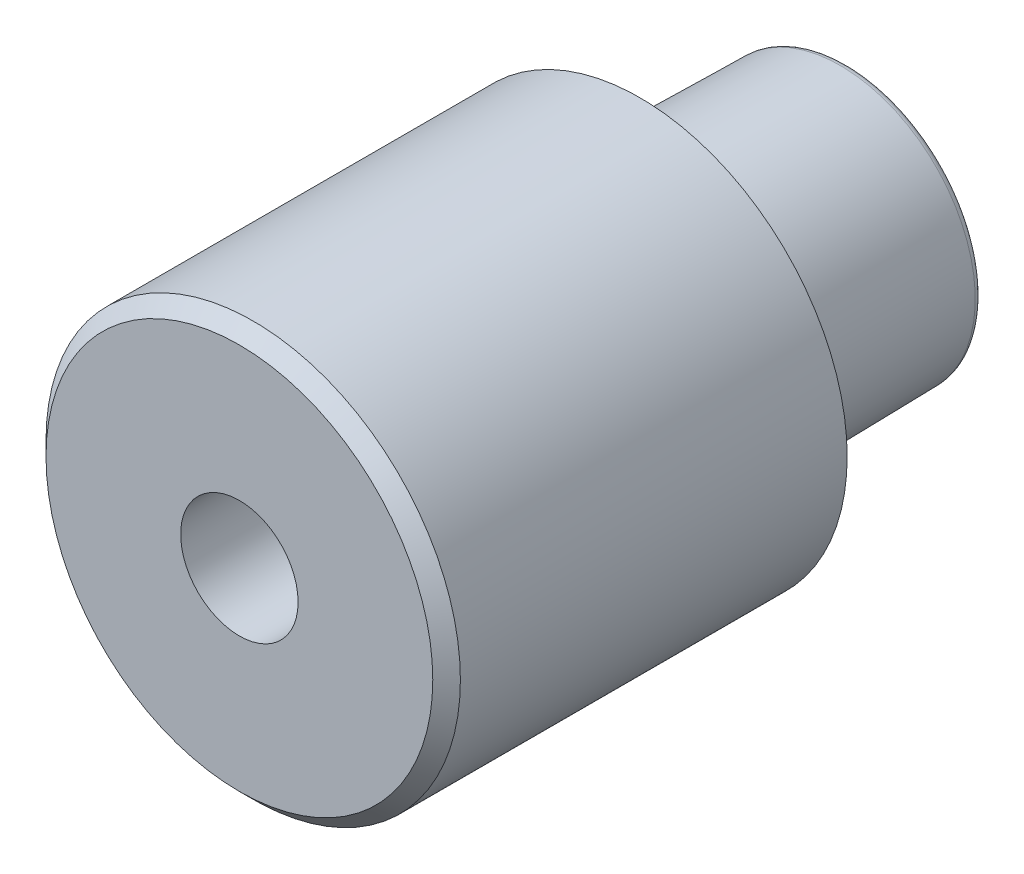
ISO-10303-21;
HEADER;
FILE_DESCRIPTION(('STEP AP214'),'2;1');
FILE_NAME('part.step','',(''),(''),'','','');
FILE_SCHEMA(('AUTOMOTIVE_DESIGN { 1 0 10303 214 1 1 1 1 }'));
ENDSEC;
DATA;
#1=APPLICATION_CONTEXT('core data for automotive mechanical design processes');
#2=APPLICATION_PROTOCOL_DEFINITION('international standard','automotive_design',2000,#1);
#3=PRODUCT_CONTEXT('',#1,'mechanical');
#4=PRODUCT('Part','Part','',(#3));
#5=PRODUCT_RELATED_PRODUCT_CATEGORY('part','',(#4));
#6=PRODUCT_DEFINITION_FORMATION('','',#4);
#7=PRODUCT_DEFINITION_CONTEXT('part definition',#1,'design');
#8=PRODUCT_DEFINITION('design','',#6,#7);
#9=PRODUCT_DEFINITION_SHAPE('','',#8);
#10=(LENGTH_UNIT() NAMED_UNIT(*) SI_UNIT(.MILLI.,.METRE.));
#11=(NAMED_UNIT(*) PLANE_ANGLE_UNIT() SI_UNIT($,.RADIAN.));
#12=(NAMED_UNIT(*) SI_UNIT($,.STERADIAN.) SOLID_ANGLE_UNIT());
#13=UNCERTAINTY_MEASURE_WITH_UNIT(LENGTH_MEASURE(1.E-05),#10,'distance_accuracy_value','');
#14=(GEOMETRIC_REPRESENTATION_CONTEXT(3) GLOBAL_UNCERTAINTY_ASSIGNED_CONTEXT((#13)) GLOBAL_UNIT_ASSIGNED_CONTEXT((#10,
#11,#12)) REPRESENTATION_CONTEXT('',''));
#15=CARTESIAN_POINT('',(0.,0.,0.));
#16=DIRECTION('',(0.,0.,1.));
#17=DIRECTION('',(1.,0.,0.));
#18=AXIS2_PLACEMENT_3D('',#15,#16,#17);
#19=CARTESIAN_POINT('',(1.5911934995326E-13,0.,22.7867965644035));
#20=DIRECTION('',(0.,0.,-1.));
#21=DIRECTION('',(1.,0.,0.));
#22=AXIS2_PLACEMENT_3D('',#19,#20,#21);
#23=CONICAL_SURFACE('',#22,21.2132034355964,0.785398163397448);
#24=CARTESIAN_POINT('',(2.09488880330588E-13,0.,30.));
#25=DIRECTION('',(0.,0.,-1.));
#26=DIRECTION('',(-1.,0.,0.));
#27=AXIS2_PLACEMENT_3D('',#24,#25,#26);
#28=CIRCLE('',#27,14.);
#29=CARTESIAN_POINT('',(-13.9999999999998,0.,30.));
#30=VERTEX_POINT('',#29);
#31=CARTESIAN_POINT('',(14.0000000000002,0.,30.));
#32=VERTEX_POINT('',#31);
#33=EDGE_CURVE('E59',#30,#32,#28,.T.);
#34=ORIENTED_EDGE('',*,*,#33,.T.);
#35=CARTESIAN_POINT('',(14.0000009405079,0.,29.9999990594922));
#36=CARTESIAN_POINT('',(15.0000023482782,0.,28.9999976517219));
#37=B_SPLINE_CURVE_WITH_KNOTS('',1,(#35,#36),.UNSPECIFIED.,.F.,.F.,(2,2),(0.659966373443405,
0.707106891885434),.UNSPECIFIED.);
#38=CARTESIAN_POINT('',(15.,0.,29.));
#39=VERTEX_POINT('',#38);
#40=EDGE_CURVE('E46',#32,#39,#37,.T.);
#41=ORIENTED_EDGE('',*,*,#40,.T.);
#42=CARTESIAN_POINT('',(2.02505917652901E-13,0.,29.));
#43=DIRECTION('',(0.,0.,1.));
#44=DIRECTION('',(-1.,0.,0.));
#45=AXIS2_PLACEMENT_3D('',#42,#43,#44);
#46=CIRCLE('',#45,15.);
#47=CARTESIAN_POINT('',(-14.9999999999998,0.,29.));
#48=VERTEX_POINT('',#47);
#49=EDGE_CURVE('E97',#39,#48,#46,.T.);
#50=ORIENTED_EDGE('',*,*,#49,.T.);
#51=CARTESIAN_POINT('',(2.02505917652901E-13,0.,29.));
#52=DIRECTION('',(0.,0.,1.));
#53=DIRECTION('',(-1.,0.,0.));
#54=AXIS2_PLACEMENT_3D('',#51,#52,#53);
#55=CIRCLE('',#54,15.);
#56=EDGE_CURVE('E11',#48,#39,#55,.T.);
#57=ORIENTED_EDGE('',*,*,#56,.T.);
#58=ORIENTED_EDGE('',*,*,#40,.F.);
#59=CARTESIAN_POINT('',(2.09488880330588E-13,0.,30.));
#60=DIRECTION('',(0.,0.,-1.));
#61=DIRECTION('',(-1.,0.,0.));
#62=AXIS2_PLACEMENT_3D('',#59,#60,#61);
#63=CIRCLE('',#62,14.);
#64=EDGE_CURVE('E94',#32,#30,#63,.T.);
#65=ORIENTED_EDGE('',*,*,#64,.T.);
#66=EDGE_LOOP('',(#34,#41,#50,#57,#58,#65));
#67=FACE_BOUND('',#66,.T.);
#68=ADVANCED_FACE('F38',(#67),#23,.T.);
#69=CARTESIAN_POINT('',(1.08235921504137E-13,0.,15.5));
#70=DIRECTION('',(0.,0.,-1.));
#71=DIRECTION('',(-1.,0.,0.));
#72=AXIS2_PLACEMENT_3D('',#69,#70,#71);
#73=CYLINDRICAL_SURFACE('',#72,15.);
#74=ORIENTED_EDGE('',*,*,#49,.F.);
#75=ORIENTED_EDGE('',*,*,#56,.F.);
#76=CARTESIAN_POINT('',(-14.9999999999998,0.,29.0000010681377));
#77=CARTESIAN_POINT('',(-15.,0.,1.00000036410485));
#78=B_SPLINE_CURVE_WITH_KNOTS('',1,(#76,#77),.UNSPECIFIED.,.F.,.F.,(2,2),(0.0833333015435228,
0.916666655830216),.UNSPECIFIED.);
#79=CARTESIAN_POINT('',(-15.,0.,1.0000000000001));
#80=VERTEX_POINT('',#79);
#81=EDGE_CURVE('E132',#48,#80,#78,.T.);
#82=ORIENTED_EDGE('',*,*,#81,.T.);
#83=CARTESIAN_POINT('',(0.,0.,1.));
#84=DIRECTION('',(0.,0.,-1.));
#85=DIRECTION('',(-1.,0.,0.));
#86=AXIS2_PLACEMENT_3D('',#83,#84,#85);
#87=CIRCLE('',#86,15.);
#88=EDGE_CURVE('E137',#80,#80,#87,.T.);
#89=ORIENTED_EDGE('',*,*,#88,.F.);
#90=ORIENTED_EDGE('',*,*,#81,.F.);
#91=EDGE_LOOP('',(#74,#75,#82,#89,#90));
#92=FACE_BOUND('',#91,.T.);
#93=ADVANCED_FACE('F182',(#92),#73,.T.);
#94=CARTESIAN_POINT('',(-18.2,-29.0984535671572,30.));
#95=DIRECTION('',(0.,0.,1.));
#96=DIRECTION('',(1.,0.,0.));
#97=AXIS2_PLACEMENT_3D('',#94,#95,#96);
#98=PLANE('',#97);
#99=CARTESIAN_POINT('',(0.,0.,29.9999999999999));
#100=DIRECTION('',(0.,0.,1.));
#101=DIRECTION('',(1.,0.,0.));
#102=AXIS2_PLACEMENT_3D('',#99,#100,#101);
#103=CIRCLE('',#102,4.24999999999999);
#104=CARTESIAN_POINT('',(4.24999999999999,0.,29.9999999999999));
#105=VERTEX_POINT('',#104);
#106=EDGE_CURVE('E95',#105,#105,#103,.T.);
#107=ORIENTED_EDGE('',*,*,#106,.F.);
#108=EDGE_LOOP('',(#107));
#109=FACE_BOUND('',#108,.T.);
#110=ORIENTED_EDGE('',*,*,#64,.F.);
#111=ORIENTED_EDGE('',*,*,#33,.F.);
#112=EDGE_LOOP('',(#110,#111));
#113=FACE_BOUND('',#112,.T.);
#114=ADVANCED_FACE('F185',(#109,#113),#98,.T.);
#115=CARTESIAN_POINT('',(0.,0.,-13.5));
#116=DIRECTION('',(0.,0.,-1.));
#117=DIRECTION('',(-1.,0.,0.));
#118=AXIS2_PLACEMENT_3D('',#115,#116,#117);
#119=TOROIDAL_SURFACE('',#118,9.26428045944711,0.5);
#120=CARTESIAN_POINT('',(0.,0.,-13.5087262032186));
#121=DIRECTION('',(0.,0.,-1.));
#122=DIRECTION('',(-1.,0.,0.));
#123=AXIS2_PLACEMENT_3D('',#120,#121,#122);
#124=CIRCLE('',#123,9.76420430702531);
#125=CARTESIAN_POINT('',(-9.7642043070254,0.,-13.5087262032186));
#126=VERTEX_POINT('',#125);
#127=EDGE_CURVE('E138',#126,#126,#124,.T.);
#128=ORIENTED_EDGE('',*,*,#127,.T.);
#129=CARTESIAN_POINT('',(-9.7642043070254,0.,-13.5087262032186));
#130=CARTESIAN_POINT('',(-9.75562909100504,0.,-13.9999999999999));
#131=CARTESIAN_POINT('',(-9.26428045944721,0.,-14.));
#132=(BOUNDED_CURVE() B_SPLINE_CURVE(2,(#129,#130,#131),.UNSPECIFIED.,.F.,
.F.) B_SPLINE_CURVE_WITH_KNOTS((3,3),(0.,0.5),
.UNSPECIFIED.) CURVE() GEOMETRIC_REPRESENTATION_ITEM() RATIONAL_B_SPLINE_CURVE((1.,
0.713250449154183,1.)) REPRESENTATION_ITEM(''));
#133=CARTESIAN_POINT('',(-9.26428045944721,0.,-14.));
#134=VERTEX_POINT('',#133);
#135=EDGE_CURVE('E121',#126,#134,#132,.T.);
#136=ORIENTED_EDGE('',*,*,#135,.T.);
#137=CARTESIAN_POINT('',(0.,0.,-14.));
#138=DIRECTION('',(0.,0.,1.));
#139=DIRECTION('',(-1.,0.,0.));
#140=AXIS2_PLACEMENT_3D('',#137,#138,#139);
#141=CIRCLE('',#140,9.26428045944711);
#142=EDGE_CURVE('E127',#134,#134,#141,.T.);
#143=ORIENTED_EDGE('',*,*,#142,.T.);
#144=ORIENTED_EDGE('',*,*,#135,.F.);
#145=EDGE_LOOP('',(#128,#136,#143,#144));
#146=FACE_BOUND('',#145,.T.);
#147=ADVANCED_FACE('F187',(#146),#119,.T.);
#148=CARTESIAN_POINT('',(0.,0.,0.));
#149=DIRECTION('',(0.,0.,1.));
#150=DIRECTION('',(-1.,0.,0.));
#151=AXIS2_PLACEMENT_3D('',#148,#149,#150);
#152=CONICAL_SURFACE('',#151,10.,0.0174532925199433);
#153=ORIENTED_EDGE('',*,*,#127,.F.);
#154=CARTESIAN_POINT('',(-9.7642043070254,0.,-13.5087262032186));
#155=CARTESIAN_POINT('',(-10.,0.,0.));
#156=B_SPLINE_CURVE_WITH_KNOTS('',1,(#154,#155),.UNSPECIFIED.,.F.,.F.,(2,2),(0.,1.),.UNSPECIFIED.);
#157=CARTESIAN_POINT('',(-10.,0.,0.));
#158=VERTEX_POINT('',#157);
#159=EDGE_CURVE('E110',#126,#158,#156,.T.);
#160=ORIENTED_EDGE('',*,*,#159,.T.);
#161=CARTESIAN_POINT('',(0.,0.,0.));
#162=DIRECTION('',(0.,0.,-1.));
#163=DIRECTION('',(-1.,0.,0.));
#164=AXIS2_PLACEMENT_3D('',#161,#162,#163);
#165=CIRCLE('',#164,10.);
#166=EDGE_CURVE('E116',#158,#158,#165,.T.);
#167=ORIENTED_EDGE('',*,*,#166,.T.);
#168=ORIENTED_EDGE('',*,*,#159,.F.);
#169=EDGE_LOOP('',(#153,#160,#167,#168));
#170=FACE_BOUND('',#169,.T.);
#171=ADVANCED_FACE('F194',(#170),#152,.T.);
#172=CARTESIAN_POINT('',(21.3078450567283,-19.2554453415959,-14.0000000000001));
#173=DIRECTION('',(0.,0.,-1.));
#174=DIRECTION('',(-1.,0.,0.));
#175=AXIS2_PLACEMENT_3D('',#172,#173,#174);
#176=PLANE('',#175);
#177=ORIENTED_EDGE('',*,*,#142,.F.);
#178=EDGE_LOOP('',(#177));
#179=FACE_BOUND('',#178,.T.);
#180=ADVANCED_FACE('F222',(#179),#176,.T.);
#181=CARTESIAN_POINT('',(0.,0.,0.5));
#182=DIRECTION('',(0.,0.,-1.));
#183=DIRECTION('',(-1.,0.,0.));
#184=AXIS2_PLACEMENT_3D('',#181,#182,#183);
#185=CYLINDRICAL_SURFACE('',#184,10.);
#186=CARTESIAN_POINT('',(0.,0.,1.));
#187=DIRECTION('',(0.,0.,1.));
#188=DIRECTION('',(-1.,0.,0.));
#189=AXIS2_PLACEMENT_3D('',#186,#187,#188);
#190=CIRCLE('',#189,10.);
#191=CARTESIAN_POINT('',(-10.,0.,1.00000000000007));
#192=VERTEX_POINT('',#191);
#193=EDGE_CURVE('E105',#192,#192,#190,.T.);
#194=ORIENTED_EDGE('',*,*,#193,.F.);
#195=CARTESIAN_POINT('',(-10.,0.,1.00000305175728));
#196=CARTESIAN_POINT('',(-10.,0.,5.31746945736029E-07));
#197=B_SPLINE_CURVE_WITH_KNOTS('',1,(#195,#196),.UNSPECIFIED.,.F.,.F.,(2,2),(0.0833307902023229,
0.91666622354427),.UNSPECIFIED.);
#198=EDGE_CURVE('E102',#192,#158,#197,.T.);
#199=ORIENTED_EDGE('',*,*,#198,.T.);
#200=ORIENTED_EDGE('',*,*,#166,.F.);
#201=ORIENTED_EDGE('',*,*,#198,.F.);
#202=EDGE_LOOP('',(#194,#199,#200,#201));
#203=FACE_BOUND('',#202,.T.);
#204=ADVANCED_FACE('F231',(#203),#185,.T.);
#205=CARTESIAN_POINT('',(34.5,-31.1769145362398,0.999999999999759));
#206=DIRECTION('',(0.,0.,-1.));
#207=DIRECTION('',(-1.,0.,0.));
#208=AXIS2_PLACEMENT_3D('',#205,#206,#207);
#209=PLANE('',#208);
#210=ORIENTED_EDGE('',*,*,#88,.T.);
#211=EDGE_LOOP('',(#210));
#212=FACE_BOUND('',#211,.T.);
#213=ORIENTED_EDGE('',*,*,#193,.T.);
#214=EDGE_LOOP('',(#213));
#215=FACE_BOUND('',#214,.T.);
#216=ADVANCED_FACE('F88',(#212,#215),#209,.T.);
#217=CARTESIAN_POINT('',(0.,0.,7.99999999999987));
#218=DIRECTION('',(0.,0.,1.));
#219=DIRECTION('',(1.,0.,0.));
#220=AXIS2_PLACEMENT_3D('',#217,#218,#219);
#221=CONICAL_SURFACE('',#220,4.24999999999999,1.02974425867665);
#222=CARTESIAN_POINT('',(0.,0.,5.44634236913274));
#223=VERTEX_POINT('',#222);
#224=VERTEX_LOOP('',#223);
#225=FACE_BOUND('',#224,.T.);
#226=CARTESIAN_POINT('',(0.,0.,7.99999999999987));
#227=DIRECTION('',(0.,0.,1.));
#228=DIRECTION('',(1.,0.,0.));
#229=AXIS2_PLACEMENT_3D('',#226,#227,#228);
#230=CIRCLE('',#229,4.24999999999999);
#231=CARTESIAN_POINT('',(4.24999999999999,0.,7.99999999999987));
#232=VERTEX_POINT('',#231);
#233=EDGE_CURVE('E92',#232,#232,#230,.T.);
#234=ORIENTED_EDGE('',*,*,#233,.T.);
#235=EDGE_LOOP('',(#234));
#236=FACE_BOUND('',#235,.T.);
#237=ADVANCED_FACE('F84',(#225,#236),#221,.F.);
#238=CARTESIAN_POINT('',(0.,0.,29.9999999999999));
#239=DIRECTION('',(0.,0.,1.));
#240=DIRECTION('',(1.,0.,0.));
#241=AXIS2_PLACEMENT_3D('',#238,#239,#240);
#242=CYLINDRICAL_SURFACE('',#241,4.24999999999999);
#243=ORIENTED_EDGE('',*,*,#233,.F.);
#244=EDGE_LOOP('',(#243));
#245=FACE_BOUND('',#244,.T.);
#246=ORIENTED_EDGE('',*,*,#106,.T.);
#247=EDGE_LOOP('',(#246));
#248=FACE_BOUND('',#247,.T.);
#249=ADVANCED_FACE('F87',(#245,#248),#242,.F.);
#250=CLOSED_SHELL('',(#68,#93,#114,#147,#171,#180,#204,#216,#237,#249));
#251=MANIFOLD_SOLID_BREP('B2',#250);
#252=ADVANCED_BREP_SHAPE_REPRESENTATION('',(#18,#251),#14);
#253=SHAPE_DEFINITION_REPRESENTATION(#9,#252);
ENDSEC;
END-ISO-10303-21;
